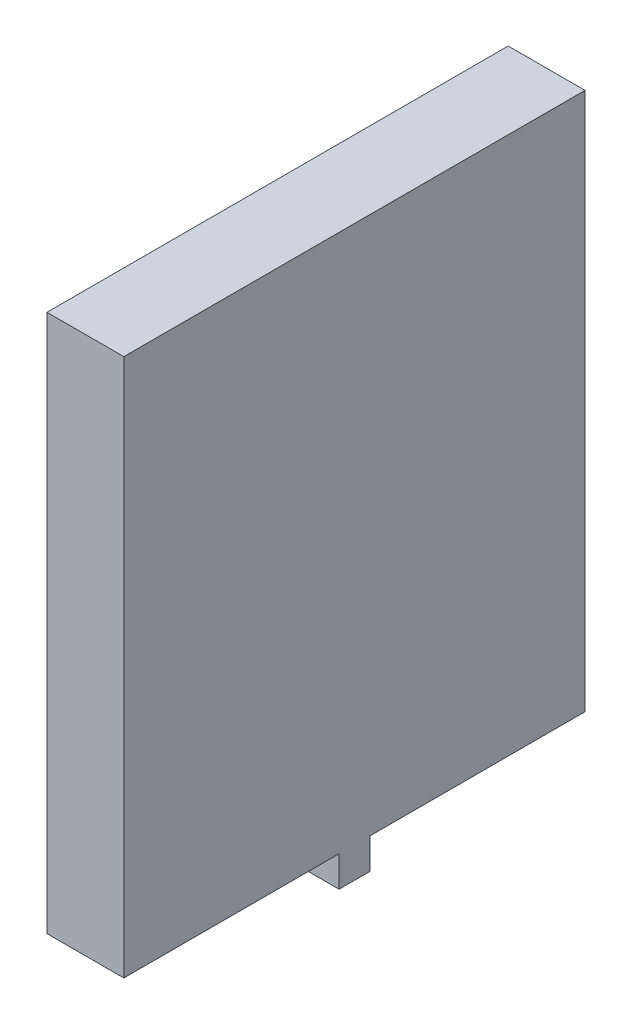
from build123d import *

# Parameters (mm, degrees)
CROQUIS1_W              = 60
CROQUIS1_H              = 70
SALIENTE_EXTRUIR1_DEPTH = 10
CROQUIS2_W              = 15
CROQUIS2_H              = 10
SALIENTE_EXTRUIR2_DEPTH = 20
CROQUIS3_R              = 3.5
CORTAR_EXTRUIR1_DEPTH   = 30
CROQUIS4_W              = 10
CROQUIS4_H              = 4
SALIENTE_EXTRUIR3_DEPTH = 4


with BuildPart() as part:
    # Croquis1 → Saliente-Extruir1 (new body)
    with BuildSketch(Plane(origin=(0, 0, 0), x_dir=(0, 0, -1), z_dir=(1, 0, 0))):
        Rectangle(CROQUIS1_W, CROQUIS1_H)
    extrude(amount=SALIENTE_EXTRUIR1_DEPTH)

    # Croquis2 → Saliente-Extruir2 (add)
    with BuildSketch(Plane.ZY):
        with Locations((0, -30)):
            Rectangle(CROQUIS2_W, CROQUIS2_H)
    extrude(amount=SALIENTE_EXTRUIR2_DEPTH)

    # Croquis3 → Cortar-Extruir1 (cut)
    with BuildSketch(Plane(origin=(0, -25, 0), x_dir=(1, 0, 0), z_dir=(0, 1, 0))):
        with Locations(Location((-14, 0, 0), (0, 0, 270))):
            Circle(CROQUIS3_R)
    extrude(amount=-CORTAR_EXTRUIR1_DEPTH, mode=Mode.SUBTRACT)

    # Croquis4 → Saliente-Extruir3 (add)
    with BuildSketch(Plane.XZ.offset(35)):
        with Locations((5, 0)):
            Rectangle(CROQUIS4_W, CROQUIS4_H)
    extrude(amount=SALIENTE_EXTRUIR3_DEPTH)


solid = part.part
